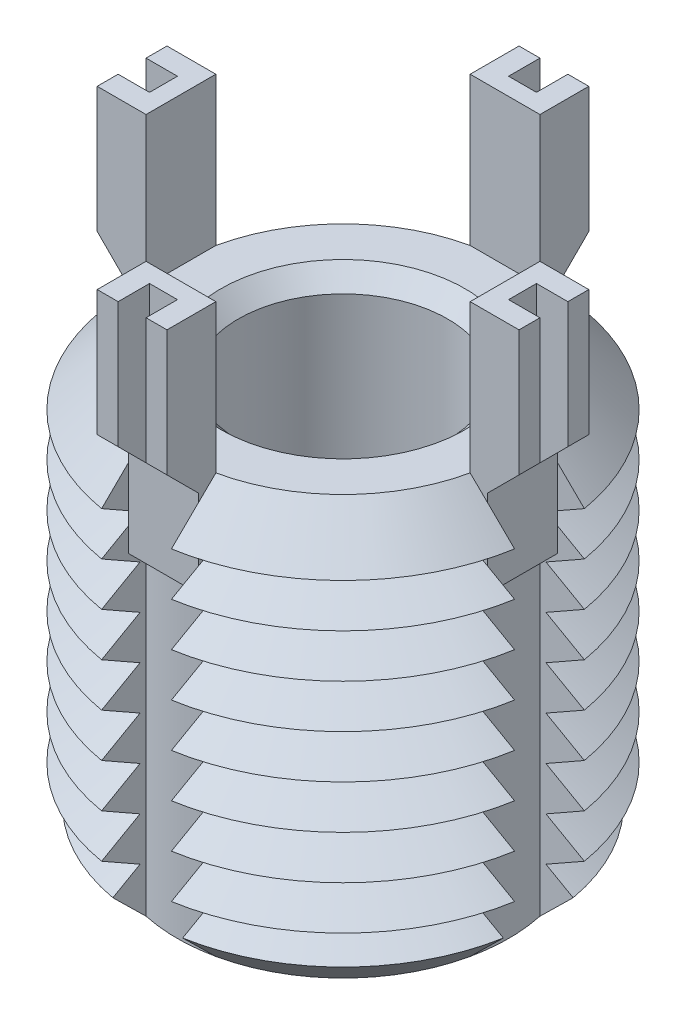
from build123d import *

# Parameters (mm, degrees)
SKETCH1_R               = 6
BOSS_EXTRUDE1_DEPTH     = 12
CHAMFER1_SIZE           = 1.25
LPATTERN1_COUNT         = 8
LPATTERN1_PITCH         = 1.25
CUT_EXTRUDE1_REACH      = 16.697
CIRPATTERN1_COUNT       = 4
BOSS_EXTRUDE3_DEPTH     = 1
CIRPATTERN2_COUNT       = 4
CUT_EXTRUDE3_DEPTH      = 19.360592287
CUT_EXTRUDE3_DEPTH_BACK = 19.360592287
SKETCH6_W               = 0.9
SKETCH6_H               = 0.8
SKETCH6_W_2             = 0.8
SKETCH6_H_2             = 0.9
SKETCH7_R               = 3
CUT_EXTRUDE4_DEPTH      = 12
CHAMFER2_SIZE           = 0.5


with BuildPart() as part:
    # Sketch1 → Boss-Extrude1 (new body)
    with BuildSketch(Plane(origin=(0, 0, 0), x_dir=(1, 0, 0), z_dir=(0, 1, 0))):
        with Locations(Location((0, 0, 0), (0, 0, 270))):
            Circle(SKETCH1_R)
    extrude(amount=-BOSS_EXTRUDE1_DEPTH)

    # Chamfer1
    chamfer1_edges = [part.edges().sort_by_distance(p)[0] for p in [
        (0, 0, -6),
        (0, -12, -6),
    ]]
    chamfer(chamfer1_edges, length=CHAMFER1_SIZE)

    # Sketch3 → Cut-Revolve1 (revolve, cut)
    with BuildSketch(Plane(origin=(0, 0, 0), x_dir=(0, 0, -1), z_dir=(1, 0, 0))):
        Polygon((-6, -1.25), (-4.917468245, -1.875), (-6, -2.5), align=None)
    cut_revolve1 = revolve(axis=Axis((0, 0.885892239, 0), (0, -1, 0)), mode=Mode.SUBTRACT)

    # LPattern1: Cut-Revolve1 ×8
    with Locations(*[(0, -i * LPATTERN1_PITCH, 0) for i in range(1, LPATTERN1_COUNT)]):
        add(cut_revolve1, mode=Mode.SUBTRACT)

    # Cut-Extrude1: up to this cone (the profile starts inside it)
    cut_extrude1_end = Plane(origin=(0, 0, 0), z_dir=(0, 1, 0)).offset(-16.749999) * Cone(1e-06, 50.697, 50.696999, align=(Align.CENTER, Align.CENTER, Align.MIN), mode=Mode.PRIVATE)
    # Sketch4 → Cut-Extrude1 (cut, up to the surface)
    with BuildSketch(Plane(origin=(0, 0, 0), x_dir=(1, 0, 0), z_dir=(0, 1, 0)), mode=Mode.PRIVATE) as cut_extrude1_sk1:
        with BuildLine():
            Line((-4.643543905, 1), (-5.916079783, 1))
            ThreePointArc((-5.916079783, 1), (-6, 0), (-5.916079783, -1))
            Line((-5.916079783, -1), (-4.643543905, -1))
            ThreePointArc((-4.643543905, -1), (-4.75, 0), (-4.643543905, 1))
        make_face()
    cut_extrude1_tool1 = extrude(cut_extrude1_sk1.sketch, amount=-CUT_EXTRUDE1_REACH, mode=Mode.PRIVATE) & cut_extrude1_end
    cut_extrude1 = cut_extrude1_tool1.solids().sort_by_distance((-5.343239, 0, 0))[0]
    add(cut_extrude1, mode=Mode.SUBTRACT)

    # CirPattern1: Cut-Extrude1 ×4 about axis
    cirpattern1_axis = Axis((0, 0, 0), (0, 1, 0))
    for i in range(1, CIRPATTERN1_COUNT):
        add(cut_extrude1.rotate(cirpattern1_axis, i * 360 / CIRPATTERN1_COUNT), mode=Mode.SUBTRACT)

    # Sketch5 → Boss-Extrude3 (add, symmetric)
    with BuildSketch(Plane(origin=(0, 0, 0), x_dir=(0, 0, -1), z_dir=(1, 0, 0))):
        Polygon((-4.643543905, 4.25), (-4.643543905, -2.75), (-5.143543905, -2.75), (-5.143543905, -0.25), (-6.043543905, 0.65), (-6.043543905, 4.25), align=None)
    boss_extrude3 = extrude(amount=BOSS_EXTRUDE3_DEPTH, both=True)

    # CirPattern2: Boss-Extrude3 ×4 about axis
    cirpattern2_axis = Axis((0, 0, 0), (0, 1, 0))
    for i in range(1, CIRPATTERN2_COUNT):
        add(boss_extrude3.rotate(cirpattern2_axis, i * 360 / CIRPATTERN2_COUNT))

    # Sketch6 → Cut-Extrude3 (cut, two sides: drawn at the far end of the back side and taken through both)
    with BuildSketch(Plane(origin=(0, 4.25, 0), x_dir=(1, 0, 0), z_dir=(0, 1, 0)).offset(-CUT_EXTRUDE3_DEPTH_BACK)):
        with Locations((-5.593543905, 0)):
            Rectangle(SKETCH6_W, SKETCH6_H)
        with Locations((0, 5.593543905)):
            Rectangle(SKETCH6_W_2, SKETCH6_H_2)
        with Locations((5.593543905, 0)):
            Rectangle(SKETCH6_W, SKETCH6_H)
        with Locations((0, -5.593543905)):
            Rectangle(SKETCH6_W_2, SKETCH6_H_2)
    extrude(amount=CUT_EXTRUDE3_DEPTH + CUT_EXTRUDE3_DEPTH_BACK, mode=Mode.SUBTRACT)

    # Sketch7 → Cut-Extrude4 (cut)
    with BuildSketch(Plane(origin=(0, 0, 0), x_dir=(1, 0, 0), z_dir=(0, 1, 0))):
        with Locations(Location((0, 0, 0), (0, 0, 270))):
            Circle(SKETCH7_R)
    extrude(amount=-CUT_EXTRUDE4_DEPTH, mode=Mode.SUBTRACT)

    # Chamfer2
    chamfer2_edges = [part.edges().sort_by_distance(p)[0] for p in [
        (0, 0, -3),
        (0, -12, -3),
    ]]
    chamfer(chamfer2_edges, length=CHAMFER2_SIZE)


solid = part.part
